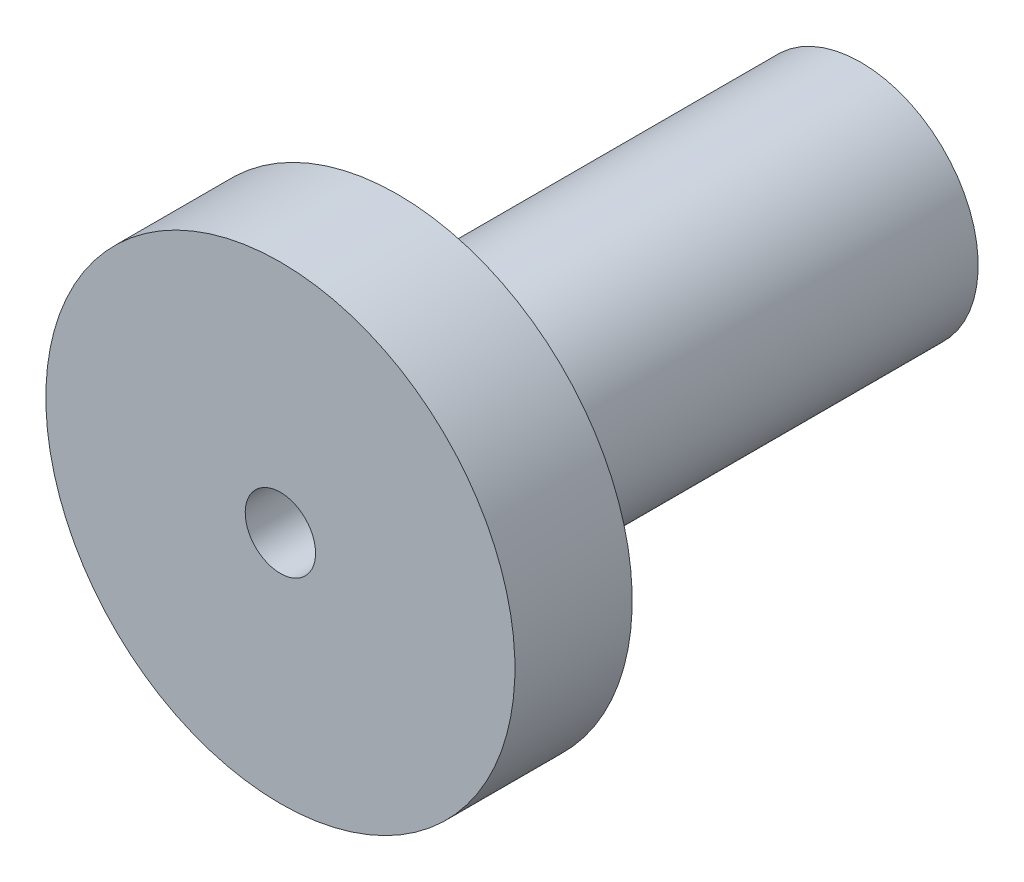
ISO-10303-21;
HEADER;
FILE_DESCRIPTION(('STEP AP214'),'2;1');
FILE_NAME('part.step','',(''),(''),'','','');
FILE_SCHEMA(('AUTOMOTIVE_DESIGN { 1 0 10303 214 1 1 1 1 }'));
ENDSEC;
DATA;
#1=APPLICATION_CONTEXT('core data for automotive mechanical design processes');
#2=APPLICATION_PROTOCOL_DEFINITION('international standard','automotive_design',2000,#1);
#3=PRODUCT_CONTEXT('',#1,'mechanical');
#4=PRODUCT('Part','Part','',(#3));
#5=PRODUCT_RELATED_PRODUCT_CATEGORY('part','',(#4));
#6=PRODUCT_DEFINITION_FORMATION('','',#4);
#7=PRODUCT_DEFINITION_CONTEXT('part definition',#1,'design');
#8=PRODUCT_DEFINITION('design','',#6,#7);
#9=PRODUCT_DEFINITION_SHAPE('','',#8);
#10=(LENGTH_UNIT() NAMED_UNIT(*) SI_UNIT(.MILLI.,.METRE.));
#11=(NAMED_UNIT(*) PLANE_ANGLE_UNIT() SI_UNIT($,.RADIAN.));
#12=(NAMED_UNIT(*) SI_UNIT($,.STERADIAN.) SOLID_ANGLE_UNIT());
#13=UNCERTAINTY_MEASURE_WITH_UNIT(LENGTH_MEASURE(1.E-05),#10,'distance_accuracy_value','');
#14=(GEOMETRIC_REPRESENTATION_CONTEXT(3) GLOBAL_UNCERTAINTY_ASSIGNED_CONTEXT((#13)) GLOBAL_UNIT_ASSIGNED_CONTEXT((#10,
#11,#12)) REPRESENTATION_CONTEXT('',''));
#15=CARTESIAN_POINT('',(0.,0.,0.));
#16=DIRECTION('',(0.,0.,1.));
#17=DIRECTION('',(1.,0.,0.));
#18=AXIS2_PLACEMENT_3D('',#15,#16,#17);
#19=CARTESIAN_POINT('',(0.,0.,-39.5));
#20=DIRECTION('',(0.,0.,-1.));
#21=DIRECTION('',(0.,1.,0.));
#22=AXIS2_PLACEMENT_3D('',#19,#20,#21);
#23=PLANE('',#22);
#24=CARTESIAN_POINT('',(0.,0.,-39.5));
#25=DIRECTION('',(0.,0.,-1.));
#26=DIRECTION('',(0.,1.,0.));
#27=AXIS2_PLACEMENT_3D('',#24,#25,#26);
#28=CIRCLE('',#27,10.);
#29=CARTESIAN_POINT('',(0.,10.,-39.5));
#30=VERTEX_POINT('',#29);
#31=EDGE_CURVE('E8',#30,#30,#28,.T.);
#32=ORIENTED_EDGE('',*,*,#31,.T.);
#33=EDGE_LOOP('',(#32));
#34=FACE_BOUND('',#33,.T.);
#35=ADVANCED_FACE('F12',(#34),#23,.T.);
#36=CARTESIAN_POINT('',(0.,0.,-49.5));
#37=DIRECTION('',(0.,0.,-1.));
#38=DIRECTION('',(0.,1.,0.));
#39=AXIS2_PLACEMENT_3D('',#36,#37,#38);
#40=CYLINDRICAL_SURFACE('',#39,10.);
#41=CARTESIAN_POINT('',(0.,0.,0.));
#42=DIRECTION('',(0.,0.,-1.));
#43=DIRECTION('',(0.,1.,0.));
#44=AXIS2_PLACEMENT_3D('',#41,#42,#43);
#45=CIRCLE('',#44,10.);
#46=CARTESIAN_POINT('',(0.,10.,0.));
#47=VERTEX_POINT('',#46);
#48=EDGE_CURVE('E18',#47,#47,#45,.T.);
#49=ORIENTED_EDGE('',*,*,#48,.T.);
#50=EDGE_LOOP('',(#49));
#51=FACE_BOUND('',#50,.T.);
#52=ORIENTED_EDGE('',*,*,#31,.F.);
#53=EDGE_LOOP('',(#52));
#54=FACE_BOUND('',#53,.T.);
#55=ADVANCED_FACE('F61',(#51,#54),#40,.T.);
#56=CARTESIAN_POINT('',(10.,0.,0.));
#57=DIRECTION('',(0.,0.,-1.));
#58=DIRECTION('',(0.,1.,0.));
#59=AXIS2_PLACEMENT_3D('',#56,#57,#58);
#60=PLANE('',#59);
#61=CARTESIAN_POINT('',(0.,0.,0.));
#62=DIRECTION('',(0.,0.,-1.));
#63=DIRECTION('',(0.,1.,0.));
#64=AXIS2_PLACEMENT_3D('',#61,#62,#63);
#65=CIRCLE('',#64,20.);
#66=CARTESIAN_POINT('',(0.,20.,0.));
#67=VERTEX_POINT('',#66);
#68=EDGE_CURVE('E22',#67,#67,#65,.T.);
#69=ORIENTED_EDGE('',*,*,#68,.T.);
#70=EDGE_LOOP('',(#69));
#71=FACE_BOUND('',#70,.T.);
#72=ORIENTED_EDGE('',*,*,#48,.F.);
#73=EDGE_LOOP('',(#72));
#74=FACE_BOUND('',#73,.T.);
#75=ADVANCED_FACE('F55',(#71,#74),#60,.T.);
#76=CARTESIAN_POINT('',(0.,0.,-49.5));
#77=DIRECTION('',(0.,0.,-1.));
#78=DIRECTION('',(0.,1.,0.));
#79=AXIS2_PLACEMENT_3D('',#76,#77,#78);
#80=CYLINDRICAL_SURFACE('',#79,20.);
#81=CARTESIAN_POINT('',(0.,0.,10.));
#82=DIRECTION('',(0.,0.,-1.));
#83=DIRECTION('',(0.,1.,0.));
#84=AXIS2_PLACEMENT_3D('',#81,#82,#83);
#85=CIRCLE('',#84,20.);
#86=CARTESIAN_POINT('',(0.,20.,10.));
#87=VERTEX_POINT('',#86);
#88=EDGE_CURVE('E26',#87,#87,#85,.T.);
#89=ORIENTED_EDGE('',*,*,#88,.T.);
#90=EDGE_LOOP('',(#89));
#91=FACE_BOUND('',#90,.T.);
#92=ORIENTED_EDGE('',*,*,#68,.F.);
#93=EDGE_LOOP('',(#92));
#94=FACE_BOUND('',#93,.T.);
#95=ADVANCED_FACE('F49',(#91,#94),#80,.T.);
#96=CARTESIAN_POINT('',(20.,0.,10.));
#97=DIRECTION('',(0.,0.,1.));
#98=DIRECTION('',(0.,-1.,0.));
#99=AXIS2_PLACEMENT_3D('',#96,#97,#98);
#100=PLANE('',#99);
#101=CARTESIAN_POINT('',(0.,0.,10.));
#102=DIRECTION('',(0.,0.,1.));
#103=DIRECTION('',(0.,-1.,0.));
#104=AXIS2_PLACEMENT_3D('',#101,#102,#103);
#105=CIRCLE('',#104,3.);
#106=CARTESIAN_POINT('',(0.,-3.,10.));
#107=VERTEX_POINT('',#106);
#108=EDGE_CURVE('E32',#107,#107,#105,.T.);
#109=ORIENTED_EDGE('',*,*,#108,.F.);
#110=EDGE_LOOP('',(#109));
#111=FACE_BOUND('',#110,.T.);
#112=ORIENTED_EDGE('',*,*,#88,.F.);
#113=EDGE_LOOP('',(#112));
#114=FACE_BOUND('',#113,.T.);
#115=ADVANCED_FACE('F43',(#111,#114),#100,.T.);
#116=CARTESIAN_POINT('',(0.,0.,-23.5));
#117=DIRECTION('',(0.,0.,1.));
#118=DIRECTION('',(0.,-1.,0.));
#119=AXIS2_PLACEMENT_3D('',#116,#117,#118);
#120=CYLINDRICAL_SURFACE('',#119,3.);
#121=CARTESIAN_POINT('',(0.,0.,-23.5));
#122=DIRECTION('',(0.,0.,1.));
#123=DIRECTION('',(0.,-1.,0.));
#124=AXIS2_PLACEMENT_3D('',#121,#122,#123);
#125=CIRCLE('',#124,3.);
#126=CARTESIAN_POINT('',(0.,-3.,-23.5));
#127=VERTEX_POINT('',#126);
#128=EDGE_CURVE('E31',#127,#127,#125,.T.);
#129=ORIENTED_EDGE('',*,*,#128,.F.);
#130=EDGE_LOOP('',(#129));
#131=FACE_BOUND('',#130,.T.);
#132=ORIENTED_EDGE('',*,*,#108,.T.);
#133=EDGE_LOOP('',(#132));
#134=FACE_BOUND('',#133,.T.);
#135=ADVANCED_FACE('F40',(#131,#134),#120,.F.);
#136=CARTESIAN_POINT('',(0.,0.,-23.5));
#137=DIRECTION('',(0.,0.,1.));
#138=DIRECTION('',(0.,-1.,0.));
#139=AXIS2_PLACEMENT_3D('',#136,#137,#138);
#140=PLANE('',#139);
#141=ORIENTED_EDGE('',*,*,#128,.T.);
#142=EDGE_LOOP('',(#141));
#143=FACE_BOUND('',#142,.T.);
#144=ADVANCED_FACE('F38',(#143),#140,.T.);
#145=CLOSED_SHELL('',(#35,#55,#75,#95,#115,#135,#144));
#146=MANIFOLD_SOLID_BREP('B1',#145);
#147=ADVANCED_BREP_SHAPE_REPRESENTATION('',(#18,#146),#14);
#148=SHAPE_DEFINITION_REPRESENTATION(#9,#147);
ENDSEC;
END-ISO-10303-21;
